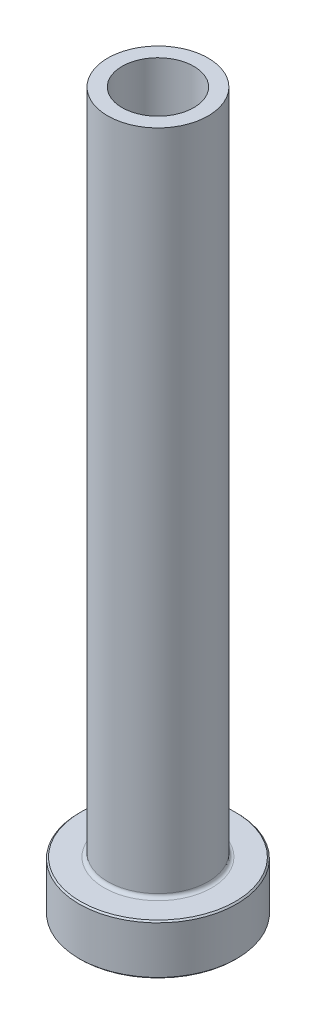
ISO-10303-21;
HEADER;
FILE_DESCRIPTION(('STEP AP214'),'2;1');
FILE_NAME('part.step','',(''),(''),'','','');
FILE_SCHEMA(('AUTOMOTIVE_DESIGN { 1 0 10303 214 1 1 1 1 }'));
ENDSEC;
DATA;
#1=APPLICATION_CONTEXT('core data for automotive mechanical design processes');
#2=APPLICATION_PROTOCOL_DEFINITION('international standard','automotive_design',2000,#1);
#3=PRODUCT_CONTEXT('',#1,'mechanical');
#4=PRODUCT('Part','Part','',(#3));
#5=PRODUCT_RELATED_PRODUCT_CATEGORY('part','',(#4));
#6=PRODUCT_DEFINITION_FORMATION('','',#4);
#7=PRODUCT_DEFINITION_CONTEXT('part definition',#1,'design');
#8=PRODUCT_DEFINITION('design','',#6,#7);
#9=PRODUCT_DEFINITION_SHAPE('','',#8);
#10=(LENGTH_UNIT() NAMED_UNIT(*) SI_UNIT(.MILLI.,.METRE.));
#11=(NAMED_UNIT(*) PLANE_ANGLE_UNIT() SI_UNIT($,.RADIAN.));
#12=(NAMED_UNIT(*) SI_UNIT($,.STERADIAN.) SOLID_ANGLE_UNIT());
#13=UNCERTAINTY_MEASURE_WITH_UNIT(LENGTH_MEASURE(1.E-05),#10,'distance_accuracy_value','');
#14=(GEOMETRIC_REPRESENTATION_CONTEXT(3) GLOBAL_UNCERTAINTY_ASSIGNED_CONTEXT((#13)) GLOBAL_UNIT_ASSIGNED_CONTEXT((#10,
#11,#12)) REPRESENTATION_CONTEXT('',''));
#15=CARTESIAN_POINT('',(0.,0.,0.));
#16=DIRECTION('',(0.,0.,1.));
#17=DIRECTION('',(1.,0.,0.));
#18=AXIS2_PLACEMENT_3D('',#15,#16,#17);
#19=CARTESIAN_POINT('',(0.,92.1876809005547,0.));
#20=DIRECTION('',(0.,1.,0.));
#21=DIRECTION('',(0.,0.,1.));
#22=AXIS2_PLACEMENT_3D('',#19,#20,#21);
#23=CYLINDRICAL_SURFACE('',#22,5.00000000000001);
#24=CARTESIAN_POINT('',(0.,100.,0.));
#25=DIRECTION('',(0.,1.,0.));
#26=DIRECTION('',(0.,0.,1.));
#27=AXIS2_PLACEMENT_3D('',#24,#25,#26);
#28=CIRCLE('',#27,5.00000000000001);
#29=CARTESIAN_POINT('',(0.,100.,5.00000000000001));
#30=VERTEX_POINT('',#29);
#31=EDGE_CURVE('E62',#30,#30,#28,.T.);
#32=ORIENTED_EDGE('',*,*,#31,.T.);
#33=EDGE_LOOP('',(#32));
#34=FACE_BOUND('',#33,.T.);
#35=CARTESIAN_POINT('',(0.,55.,0.));
#36=DIRECTION('',(0.,1.,0.));
#37=DIRECTION('',(0.,0.,1.));
#38=AXIS2_PLACEMENT_3D('',#35,#36,#37);
#39=CIRCLE('',#38,5.00000000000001);
#40=CARTESIAN_POINT('',(0.,55.,5.00000000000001));
#41=VERTEX_POINT('',#40);
#42=EDGE_CURVE('E71',#41,#41,#39,.T.);
#43=ORIENTED_EDGE('',*,*,#42,.F.);
#44=EDGE_LOOP('',(#43));
#45=FACE_BOUND('',#44,.T.);
#46=ADVANCED_FACE('F30',(#34,#45),#23,.F.);
#47=CARTESIAN_POINT('',(-5.00000000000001,100.,0.));
#48=DIRECTION('',(0.,1.,0.));
#49=DIRECTION('',(0.,0.,1.));
#50=AXIS2_PLACEMENT_3D('',#47,#48,#49);
#51=PLANE('',#50);
#52=CARTESIAN_POINT('',(0.,100.,0.));
#53=DIRECTION('',(0.,1.,0.));
#54=DIRECTION('',(0.,0.,1.));
#55=AXIS2_PLACEMENT_3D('',#52,#53,#54);
#56=CIRCLE('',#55,7.);
#57=CARTESIAN_POINT('',(0.,100.,7.));
#58=VERTEX_POINT('',#57);
#59=EDGE_CURVE('E65',#58,#58,#56,.T.);
#60=ORIENTED_EDGE('',*,*,#59,.T.);
#61=EDGE_LOOP('',(#60));
#62=FACE_BOUND('',#61,.T.);
#63=ORIENTED_EDGE('',*,*,#31,.F.);
#64=EDGE_LOOP('',(#63));
#65=FACE_BOUND('',#64,.T.);
#66=ADVANCED_FACE('F79',(#62,#65),#51,.T.);
#67=CARTESIAN_POINT('',(0.,92.1876809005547,0.));
#68=DIRECTION('',(0.,1.,0.));
#69=DIRECTION('',(0.,0.,1.));
#70=AXIS2_PLACEMENT_3D('',#67,#68,#69);
#71=CYLINDRICAL_SURFACE('',#70,7.);
#72=CARTESIAN_POINT('',(0.,7.50000000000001,0.));
#73=DIRECTION('',(0.,1.,0.));
#74=DIRECTION('',(0.,0.,1.));
#75=AXIS2_PLACEMENT_3D('',#72,#73,#74);
#76=CIRCLE('',#75,7.);
#77=CARTESIAN_POINT('',(0.,7.50000000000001,7.));
#78=VERTEX_POINT('',#77);
#79=EDGE_CURVE('E59',#78,#78,#76,.T.);
#80=ORIENTED_EDGE('',*,*,#79,.T.);
#81=EDGE_LOOP('',(#80));
#82=FACE_BOUND('',#81,.T.);
#83=ORIENTED_EDGE('',*,*,#59,.F.);
#84=EDGE_LOOP('',(#83));
#85=FACE_BOUND('',#84,.T.);
#86=ADVANCED_FACE('F85',(#82,#85),#71,.T.);
#87=CARTESIAN_POINT('',(-6.99999999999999,7.,0.));
#88=DIRECTION('',(0.,1.,0.));
#89=DIRECTION('',(0.,0.,1.));
#90=AXIS2_PLACEMENT_3D('',#87,#88,#89);
#91=PLANE('',#90);
#92=CARTESIAN_POINT('',(0.,7.,0.));
#93=DIRECTION('',(0.,1.,0.));
#94=DIRECTION('',(0.,0.,1.));
#95=AXIS2_PLACEMENT_3D('',#92,#93,#94);
#96=CIRCLE('',#95,10.8);
#97=CARTESIAN_POINT('',(0.,7.,10.8));
#98=VERTEX_POINT('',#97);
#99=EDGE_CURVE('E53',#98,#98,#96,.T.);
#100=ORIENTED_EDGE('',*,*,#99,.T.);
#101=EDGE_LOOP('',(#100));
#102=FACE_BOUND('',#101,.T.);
#103=CARTESIAN_POINT('',(0.,7.,0.));
#104=DIRECTION('',(0.,1.,0.));
#105=DIRECTION('',(0.,0.,1.));
#106=AXIS2_PLACEMENT_3D('',#103,#104,#105);
#107=CIRCLE('',#106,7.5);
#108=CARTESIAN_POINT('',(0.,7.,7.5));
#109=VERTEX_POINT('',#108);
#110=EDGE_CURVE('E56',#109,#109,#107,.F.);
#111=ORIENTED_EDGE('',*,*,#110,.T.);
#112=EDGE_LOOP('',(#111));
#113=FACE_BOUND('',#112,.T.);
#114=ADVANCED_FACE('F111',(#102,#113),#91,.T.);
#115=CARTESIAN_POINT('',(0.,92.1876809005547,0.));
#116=DIRECTION('',(0.,1.,0.));
#117=DIRECTION('',(0.,0.,1.));
#118=AXIS2_PLACEMENT_3D('',#115,#116,#117);
#119=CYLINDRICAL_SURFACE('',#118,11.);
#120=CARTESIAN_POINT('',(0.,6.80000000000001,0.));
#121=DIRECTION('',(0.,1.,0.));
#122=DIRECTION('',(0.,0.,1.));
#123=AXIS2_PLACEMENT_3D('',#120,#121,#122);
#124=CIRCLE('',#123,11.);
#125=CARTESIAN_POINT('',(0.,6.80000000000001,11.));
#126=VERTEX_POINT('',#125);
#127=EDGE_CURVE('E45',#126,#126,#124,.F.);
#128=ORIENTED_EDGE('',*,*,#127,.T.);
#129=EDGE_LOOP('',(#128));
#130=FACE_BOUND('',#129,.T.);
#131=CARTESIAN_POINT('',(0.,0.20000000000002,0.));
#132=DIRECTION('',(0.,-1.,0.));
#133=DIRECTION('',(0.,0.,-1.));
#134=AXIS2_PLACEMENT_3D('',#131,#132,#133);
#135=CIRCLE('',#134,11.);
#136=CARTESIAN_POINT('',(0.,0.20000000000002,-11.));
#137=VERTEX_POINT('',#136);
#138=EDGE_CURVE('E50',#137,#137,#135,.F.);
#139=ORIENTED_EDGE('',*,*,#138,.T.);
#140=EDGE_LOOP('',(#139));
#141=FACE_BOUND('',#140,.T.);
#142=ADVANCED_FACE('F108',(#130,#141),#119,.T.);
#143=CARTESIAN_POINT('',(-11.,0.,0.));
#144=DIRECTION('',(0.,-1.,0.));
#145=DIRECTION('',(0.,0.,-1.));
#146=AXIS2_PLACEMENT_3D('',#143,#144,#145);
#147=PLANE('',#146);
#148=CARTESIAN_POINT('',(0.,0.,0.));
#149=DIRECTION('',(0.,-1.,0.));
#150=DIRECTION('',(0.,0.,-1.));
#151=AXIS2_PLACEMENT_3D('',#148,#149,#150);
#152=CIRCLE('',#151,5.75000000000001);
#153=CARTESIAN_POINT('',(0.,0.,-5.75000000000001));
#154=VERTEX_POINT('',#153);
#155=EDGE_CURVE('E37',#154,#154,#152,.F.);
#156=ORIENTED_EDGE('',*,*,#155,.T.);
#157=EDGE_LOOP('',(#156));
#158=FACE_BOUND('',#157,.T.);
#159=CARTESIAN_POINT('',(0.,0.,0.));
#160=DIRECTION('',(0.,-1.,0.));
#161=DIRECTION('',(0.,0.,-1.));
#162=AXIS2_PLACEMENT_3D('',#159,#160,#161);
#163=CIRCLE('',#162,10.8);
#164=CARTESIAN_POINT('',(0.,0.,-10.8));
#165=VERTEX_POINT('',#164);
#166=EDGE_CURVE('E41',#165,#165,#163,.T.);
#167=ORIENTED_EDGE('',*,*,#166,.T.);
#168=EDGE_LOOP('',(#167));
#169=FACE_BOUND('',#168,.T.);
#170=ADVANCED_FACE('F110',(#158,#169),#147,.T.);
#171=CARTESIAN_POINT('',(0.,92.1876809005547,0.));
#172=DIRECTION('',(0.,1.,0.));
#173=DIRECTION('',(0.,0.,1.));
#174=AXIS2_PLACEMENT_3D('',#171,#172,#173);
#175=CYLINDRICAL_SURFACE('',#174,5.24999999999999);
#176=CARTESIAN_POINT('',(0.,0.5,0.));
#177=DIRECTION('',(0.,-1.,0.));
#178=DIRECTION('',(0.,0.,-1.));
#179=AXIS2_PLACEMENT_3D('',#176,#177,#178);
#180=CIRCLE('',#179,5.24999999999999);
#181=CARTESIAN_POINT('',(0.,0.5,-5.24999999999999));
#182=VERTEX_POINT('',#181);
#183=EDGE_CURVE('E10',#182,#182,#180,.T.);
#184=ORIENTED_EDGE('',*,*,#183,.T.);
#185=EDGE_LOOP('',(#184));
#186=FACE_BOUND('',#185,.T.);
#187=CARTESIAN_POINT('',(0.,43.,0.));
#188=DIRECTION('',(0.,1.,0.));
#189=DIRECTION('',(0.,0.,1.));
#190=AXIS2_PLACEMENT_3D('',#187,#188,#189);
#191=CIRCLE('',#190,5.25);
#192=CARTESIAN_POINT('',(0.,43.,5.25));
#193=VERTEX_POINT('',#192);
#194=EDGE_CURVE('E68',#193,#193,#191,.T.);
#195=ORIENTED_EDGE('',*,*,#194,.T.);
#196=EDGE_LOOP('',(#195));
#197=FACE_BOUND('',#196,.T.);
#198=ADVANCED_FACE('F118',(#186,#197),#175,.F.);
#199=CARTESIAN_POINT('',(0.,43.,0.));
#200=DIRECTION('',(0.,-1.,0.));
#201=DIRECTION('',(0.,0.,-1.));
#202=AXIS2_PLACEMENT_3D('',#199,#200,#201);
#203=CONICAL_SURFACE('',#202,5.25,0.020830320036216);
#204=ORIENTED_EDGE('',*,*,#42,.T.);
#205=EDGE_LOOP('',(#204));
#206=FACE_BOUND('',#205,.T.);
#207=ORIENTED_EDGE('',*,*,#194,.F.);
#208=EDGE_LOOP('',(#207));
#209=FACE_BOUND('',#208,.T.);
#210=ADVANCED_FACE('F75',(#206,#209),#203,.F.);
#211=CARTESIAN_POINT('',(0.,7.50000000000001,0.));
#212=DIRECTION('',(0.,1.,0.));
#213=DIRECTION('',(0.,0.,1.));
#214=AXIS2_PLACEMENT_3D('',#211,#212,#213);
#215=TOROIDAL_SURFACE('',#214,7.5,0.5);
#216=ORIENTED_EDGE('',*,*,#110,.F.);
#217=EDGE_LOOP('',(#216));
#218=FACE_BOUND('',#217,.T.);
#219=ORIENTED_EDGE('',*,*,#79,.F.);
#220=EDGE_LOOP('',(#219));
#221=FACE_BOUND('',#220,.T.);
#222=ADVANCED_FACE('F90',(#218,#221),#215,.F.);
#223=CARTESIAN_POINT('',(0.,7.00000000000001,0.));
#224=DIRECTION('',(0.,-1.,0.));
#225=DIRECTION('',(0.,0.,-1.));
#226=AXIS2_PLACEMENT_3D('',#223,#224,#225);
#227=CONICAL_SURFACE('',#226,10.8,0.785398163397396);
#228=ORIENTED_EDGE('',*,*,#127,.F.);
#229=EDGE_LOOP('',(#228));
#230=FACE_BOUND('',#229,.T.);
#231=ORIENTED_EDGE('',*,*,#99,.F.);
#232=EDGE_LOOP('',(#231));
#233=FACE_BOUND('',#232,.T.);
#234=ADVANCED_FACE('F93',(#230,#233),#227,.T.);
#235=CARTESIAN_POINT('',(0.,0.20000000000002,0.));
#236=DIRECTION('',(0.,1.,0.));
#237=DIRECTION('',(0.,0.,1.));
#238=AXIS2_PLACEMENT_3D('',#235,#236,#237);
#239=CONICAL_SURFACE('',#238,11.,0.785398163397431);
#240=ORIENTED_EDGE('',*,*,#166,.F.);
#241=EDGE_LOOP('',(#240));
#242=FACE_BOUND('',#241,.T.);
#243=ORIENTED_EDGE('',*,*,#138,.F.);
#244=EDGE_LOOP('',(#243));
#245=FACE_BOUND('',#244,.T.);
#246=ADVANCED_FACE('F96',(#242,#245),#239,.T.);
#247=CARTESIAN_POINT('',(0.,0.,0.));
#248=DIRECTION('',(0.,-1.,0.));
#249=DIRECTION('',(0.,0.,-1.));
#250=AXIS2_PLACEMENT_3D('',#247,#248,#249);
#251=CONICAL_SURFACE('',#250,5.75000000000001,0.78539816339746);
#252=ORIENTED_EDGE('',*,*,#183,.F.);
#253=EDGE_LOOP('',(#252));
#254=FACE_BOUND('',#253,.T.);
#255=ORIENTED_EDGE('',*,*,#155,.F.);
#256=EDGE_LOOP('',(#255));
#257=FACE_BOUND('',#256,.T.);
#258=ADVANCED_FACE('F32',(#254,#257),#251,.F.);
#259=CLOSED_SHELL('',(#46,#66,#86,#114,#142,#170,#198,#210,#222,#234,#246,#258));
#260=MANIFOLD_SOLID_BREP('B2',#259);
#261=ADVANCED_BREP_SHAPE_REPRESENTATION('',(#18,#260),#14);
#262=SHAPE_DEFINITION_REPRESENTATION(#9,#261);
ENDSEC;
END-ISO-10303-21;
